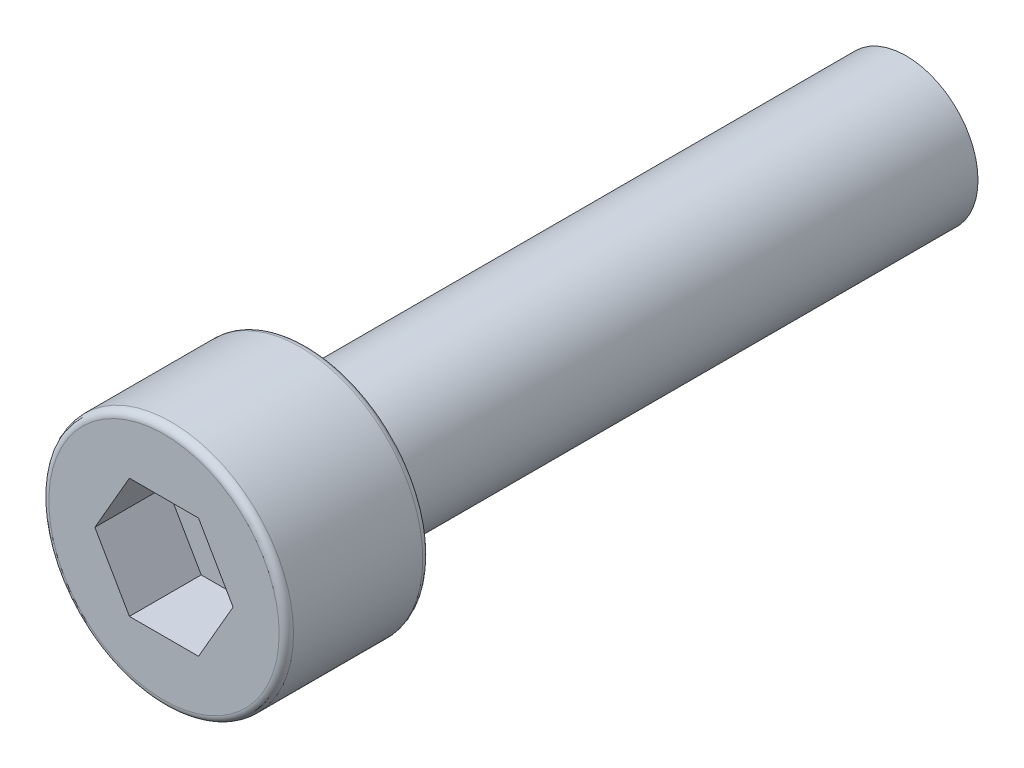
from build123d import *

# Parameters (mm, degrees)
SKETCH1_R           = 3
BOSS_EXTRUDE1_DEPTH = 25
SKETCH2_R           = 5.11
BOSS_EXTRUDE2_DEPTH = 6
CUT_EXTRUDE1_DEPTH  = 3
FILLET1_R           = 0.3


with BuildPart() as part:
    # Sketch1 → Boss-Extrude1 (new body)
    with BuildSketch(Plane(origin=(0, 0, 0), x_dir=(0, 1, 0), z_dir=(0, 0, 1))):
        with Locations(Location((0, 0, 0), (0, 0, 270))):
            Circle(SKETCH1_R)
    extrude(amount=BOSS_EXTRUDE1_DEPTH)

    # Sketch2 → Boss-Extrude2 (add)
    with BuildSketch(Plane.XY.offset(25)):
        Circle(SKETCH2_R)
    extrude(amount=BOSS_EXTRUDE2_DEPTH)

    # Sketch3 → Cut-Extrude1 (cut)
    with BuildSketch(Plane.XY.offset(31)):
        Polygon((2.886751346, 0), (1.443375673, 2.5), (-1.443375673, 2.5), (-2.886751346, 0), (-1.443375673, -2.5), (1.443375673, -2.5), align=None)
    extrude(amount=-CUT_EXTRUDE1_DEPTH, mode=Mode.SUBTRACT)

    # Fillet1
    fillet1_edges = [part.edges().sort_by_distance(p)[0] for p in [
        (-5.11, 0, 25),
        (-5.11, 0, 31),
    ]]
    fillet(fillet1_edges, radius=FILLET1_R)


solid = part.part
